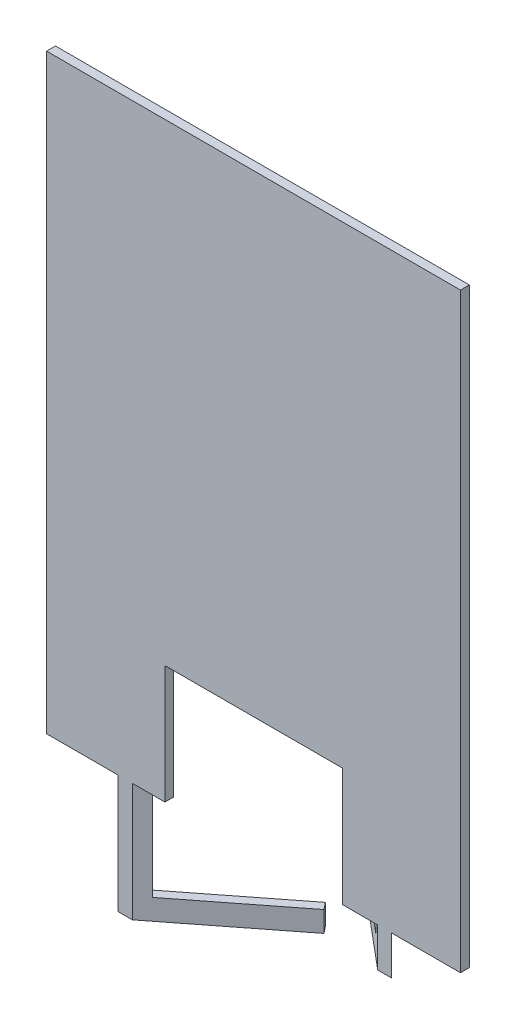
from build123d import *

# Parameters (mm, degrees)
SKETCH1_W           = 177.8
SKETCH1_H           = 254
BOSS_EXTRUDE1_DEPTH = 3.81
BOSS_EXTRUDE2_DEPTH = 157.48
BOSS_EXTRUDE3_DEPTH = 190.5
SKETCH4_W           = 35.284503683
SKETCH4_H           = 172.72
CUT_EXTRUDE1_DEPTH  = 83.02589
BOSS_EXTRUDE4_DEPTH = 1.905
SKETCH6_W           = 33.741652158
SKETCH6_H           = 105.664
SKETCH6_W_2         = 59.138297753
SKETCH6_H_2         = 68.328745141
CUT_EXTRUDE2_DEPTH  = 76.83403
SKETCH7_W           = 76.2
SKETCH7_H           = 50.8
CUT_EXTRUDE3_DEPTH  = 320.454607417


with BuildPart() as part:
    # Sketch1 → Boss-Extrude1 (new body)
    with BuildSketch(Plane.XY):
        with Locations((0, -127)):
            Rectangle(SKETCH1_W, SKETCH1_H)
    extrude(amount=BOSS_EXTRUDE1_DEPTH)

    # Sketch2 → Boss-Extrude2 (add)
    with BuildSketch(Plane.XZ.offset(304.8)):
        Polygon((59.26730778, 3.81), (14.514991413, -33.741652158), (12.06597062, -30.82302283), (53.34, 3.81), align=None)
    extrude(amount=-BOSS_EXTRUDE2_DEPTH)

    # Sketch3 → Boss-Extrude3 (add)
    with BuildSketch(Plane.XZ.offset(304.8)):
        Polygon((-52.07, 3.81), (-58.258465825, 3.81), (-8.219782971, -35.284503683), (-5.87411275, -32.282182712), align=None)
    extrude(amount=-BOSS_EXTRUDE3_DEPTH)

    # Sketch4 → Cut-Extrude1 (cut)
    with BuildSketch(Plane.ZY.offset(88.9)):
        with Locations((-17.642251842, -209.55)):
            Rectangle(SKETCH4_W, SKETCH4_H)
    extrude(amount=-CUT_EXTRUDE1_DEPTH, mode=Mode.SUBTRACT)

    # Sketch5 → Boss-Extrude4 (add, symmetric)
    with BuildSketch(Plane(origin=(0, -118.745, 0), x_dir=(1, 0, 0), z_dir=(0, 1, 0))):
        Polygon((-5.87411275, 32.282182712), (-5.87411275, 0), (-47.193422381, 0), align=None)
    extrude(amount=BOSS_EXTRUDE4_DEPTH, both=True)

    # Sketch6 → Cut-Extrude2 (cut)
    with BuildSketch(Plane(origin=(88.9, 0, 0), x_dir=(0, 0, -1), z_dir=(1, 0, 0))):
        with Locations((16.870826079, -209.042)):
            Rectangle(SKETCH6_W, SKETCH6_H)
        with Locations((4.172503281, -304.928372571)):
            Rectangle(SKETCH6_W_2, SKETCH6_H_2)
    extrude(amount=-CUT_EXTRUDE2_DEPTH, mode=Mode.SUBTRACT)

    # Sketch7 → Cut-Extrude3 (cut, through all)
    with BuildSketch(Plane(origin=(0, 0, 0), x_dir=(-1, 0, 0), z_dir=(0, 0, -1))):
        with Locations((0, -228.6)):
            Rectangle(SKETCH7_W, SKETCH7_H)
    extrude(amount=-CUT_EXTRUDE3_DEPTH, mode=Mode.SUBTRACT)


solid = part.part
